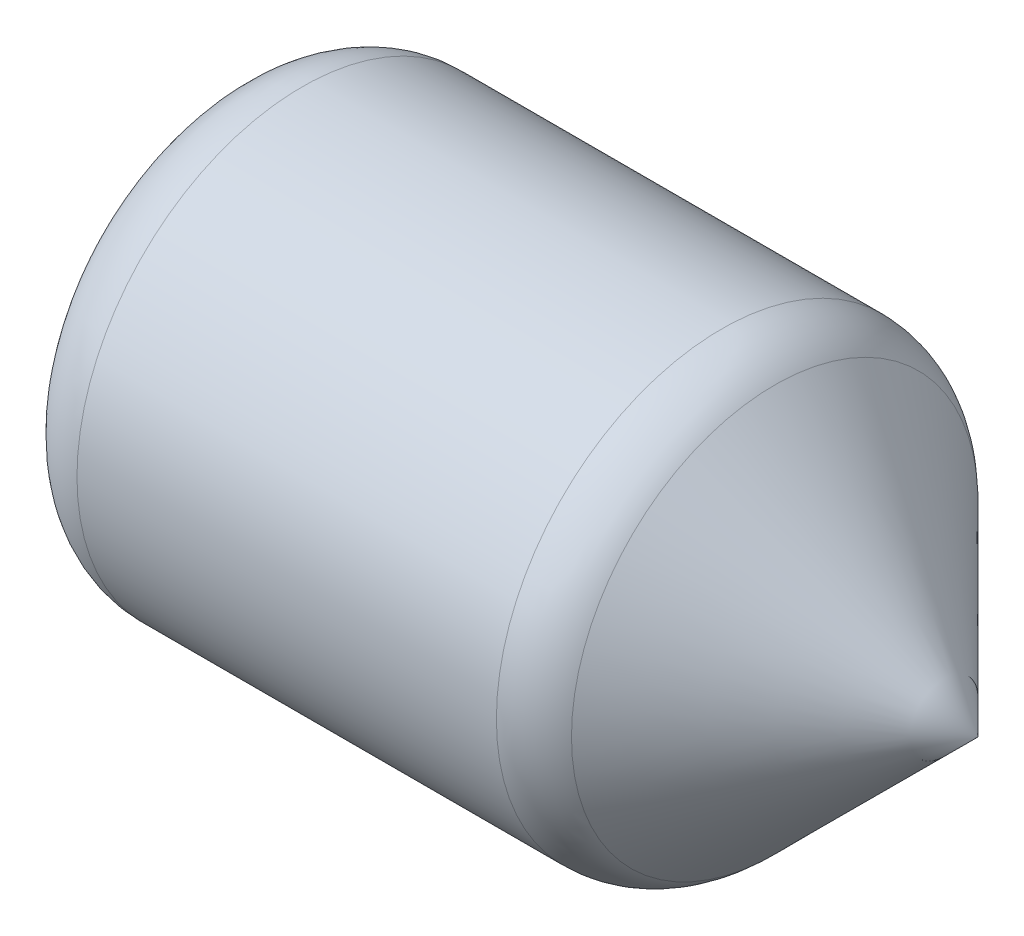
ISO-10303-21;
HEADER;
FILE_DESCRIPTION(('STEP AP214'),'2;1');
FILE_NAME('part.step','',(''),(''),'','','');
FILE_SCHEMA(('AUTOMOTIVE_DESIGN { 1 0 10303 214 1 1 1 1 }'));
ENDSEC;
DATA;
#1=APPLICATION_CONTEXT('core data for automotive mechanical design processes');
#2=APPLICATION_PROTOCOL_DEFINITION('international standard','automotive_design',2000,#1);
#3=PRODUCT_CONTEXT('',#1,'mechanical');
#4=PRODUCT('Part','Part','',(#3));
#5=PRODUCT_RELATED_PRODUCT_CATEGORY('part','',(#4));
#6=PRODUCT_DEFINITION_FORMATION('','',#4);
#7=PRODUCT_DEFINITION_CONTEXT('part definition',#1,'design');
#8=PRODUCT_DEFINITION('design','',#6,#7);
#9=PRODUCT_DEFINITION_SHAPE('','',#8);
#10=(LENGTH_UNIT() NAMED_UNIT(*) SI_UNIT(.MILLI.,.METRE.));
#11=(NAMED_UNIT(*) PLANE_ANGLE_UNIT() SI_UNIT($,.RADIAN.));
#12=(NAMED_UNIT(*) SI_UNIT($,.STERADIAN.) SOLID_ANGLE_UNIT());
#13=UNCERTAINTY_MEASURE_WITH_UNIT(LENGTH_MEASURE(1.E-05),#10,'distance_accuracy_value','');
#14=(GEOMETRIC_REPRESENTATION_CONTEXT(3) GLOBAL_UNCERTAINTY_ASSIGNED_CONTEXT((#13)) GLOBAL_UNIT_ASSIGNED_CONTEXT((#10,
#11,#12)) REPRESENTATION_CONTEXT('',''));
#15=CARTESIAN_POINT('',(0.,0.,0.));
#16=DIRECTION('',(0.,0.,1.));
#17=DIRECTION('',(1.,0.,0.));
#18=AXIS2_PLACEMENT_3D('',#15,#16,#17);
#19=CARTESIAN_POINT('',(0.,0.,0.));
#20=DIRECTION('',(1.,0.,0.));
#21=DIRECTION('',(0.,0.,-1.));
#22=AXIS2_PLACEMENT_3D('',#19,#20,#21);
#23=PLANE('',#22);
#24=CARTESIAN_POINT('',(0.,0.,0.));
#25=DIRECTION('',(-1.,0.,0.));
#26=DIRECTION('',(0.,0.,1.));
#27=AXIS2_PLACEMENT_3D('',#24,#25,#26);
#28=CIRCLE('',#27,20.);
#29=CARTESIAN_POINT('',(0.,0.,20.));
#30=VERTEX_POINT('',#29);
#31=EDGE_CURVE('E11',#30,#30,#28,.T.);
#32=ORIENTED_EDGE('',*,*,#31,.T.);
#33=EDGE_LOOP('',(#32));
#34=FACE_BOUND('',#33,.T.);
#35=ADVANCED_FACE('F33',(#34),#23,.F.);
#36=CARTESIAN_POINT('',(10.,0.,0.));
#37=DIRECTION('',(-1.,0.,0.));
#38=DIRECTION('',(0.,0.,1.));
#39=AXIS2_PLACEMENT_3D('',#36,#37,#38);
#40=TOROIDAL_SURFACE('',#39,20.0000000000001,10.);
#41=ORIENTED_EDGE('',*,*,#31,.F.);
#42=EDGE_LOOP('',(#41));
#43=FACE_BOUND('',#42,.T.);
#44=CARTESIAN_POINT('',(10.0000000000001,0.,0.));
#45=DIRECTION('',(-1.,0.,0.));
#46=DIRECTION('',(0.,0.,1.));
#47=AXIS2_PLACEMENT_3D('',#44,#45,#46);
#48=CIRCLE('',#47,30.0000000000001);
#49=CARTESIAN_POINT('',(10.0000000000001,0.,30.0000000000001));
#50=VERTEX_POINT('',#49);
#51=EDGE_CURVE('E39',#50,#50,#48,.T.);
#52=ORIENTED_EDGE('',*,*,#51,.T.);
#53=EDGE_LOOP('',(#52));
#54=FACE_BOUND('',#53,.T.);
#55=ADVANCED_FACE('F55',(#43,#54),#40,.T.);
#56=CARTESIAN_POINT('',(0.,0.,0.));
#57=DIRECTION('',(-1.,0.,0.));
#58=DIRECTION('',(0.,0.,1.));
#59=AXIS2_PLACEMENT_3D('',#56,#57,#58);
#60=CYLINDRICAL_SURFACE('',#59,30.0000000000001);
#61=ORIENTED_EDGE('',*,*,#51,.F.);
#62=EDGE_LOOP('',(#61));
#63=FACE_BOUND('',#62,.T.);
#64=CARTESIAN_POINT('',(65.857864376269,0.,0.));
#65=DIRECTION('',(-1.,0.,0.));
#66=DIRECTION('',(0.,0.,1.));
#67=AXIS2_PLACEMENT_3D('',#64,#65,#66);
#68=CIRCLE('',#67,30.0000000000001);
#69=CARTESIAN_POINT('',(65.857864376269,0.,30.0000000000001));
#70=VERTEX_POINT('',#69);
#71=EDGE_CURVE('E66',#70,#70,#68,.T.);
#72=ORIENTED_EDGE('',*,*,#71,.T.);
#73=EDGE_LOOP('',(#72));
#74=FACE_BOUND('',#73,.T.);
#75=ADVANCED_FACE('F50',(#63,#74),#60,.T.);
#76=CARTESIAN_POINT('',(65.857864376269,0.,0.));
#77=DIRECTION('',(-1.,0.,0.));
#78=DIRECTION('',(0.,0.,1.));
#79=AXIS2_PLACEMENT_3D('',#76,#77,#78);
#80=TOROIDAL_SURFACE('',#79,20.0000000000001,10.);
#81=ORIENTED_EDGE('',*,*,#71,.F.);
#82=EDGE_LOOP('',(#81));
#83=FACE_BOUND('',#82,.T.);
#84=CARTESIAN_POINT('',(72.9289321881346,0.,0.));
#85=DIRECTION('',(-1.,0.,0.));
#86=DIRECTION('',(0.,0.,1.));
#87=AXIS2_PLACEMENT_3D('',#84,#85,#86);
#88=CIRCLE('',#87,27.0710678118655);
#89=CARTESIAN_POINT('',(72.9289321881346,0.,27.0710678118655));
#90=VERTEX_POINT('',#89);
#91=EDGE_CURVE('E68',#90,#90,#88,.T.);
#92=ORIENTED_EDGE('',*,*,#91,.T.);
#93=EDGE_LOOP('',(#92));
#94=FACE_BOUND('',#93,.T.);
#95=ADVANCED_FACE('F44',(#83,#94),#80,.T.);
#96=CARTESIAN_POINT('',(100.,0.,0.));
#97=DIRECTION('',(-1.,0.,0.));
#98=DIRECTION('',(0.,0.,1.));
#99=AXIS2_PLACEMENT_3D('',#96,#97,#98);
#100=CONICAL_SURFACE('',#99,0.,0.78539816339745);
#101=ORIENTED_EDGE('',*,*,#91,.F.);
#102=EDGE_LOOP('',(#101));
#103=FACE_BOUND('',#102,.T.);
#104=CARTESIAN_POINT('',(100.,0.,0.));
#105=VERTEX_POINT('',#104);
#106=VERTEX_LOOP('',#105);
#107=FACE_BOUND('',#106,.T.);
#108=ADVANCED_FACE('F42',(#103,#107),#100,.T.);
#109=CLOSED_SHELL('',(#35,#55,#75,#95,#108));
#110=MANIFOLD_SOLID_BREP('B2',#109);
#111=ADVANCED_BREP_SHAPE_REPRESENTATION('',(#18,#110),#14);
#112=SHAPE_DEFINITION_REPRESENTATION(#9,#111);
ENDSEC;
END-ISO-10303-21;
